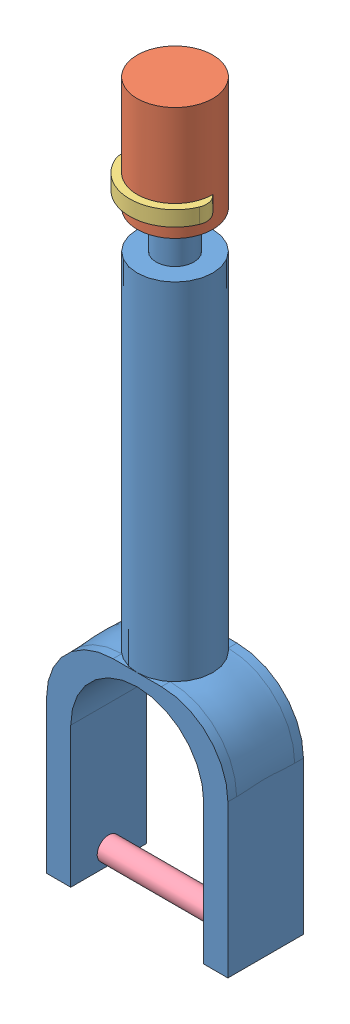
SolidWorks assembly Front gear assembly.SLDASM, configuration Default (file format 11000). Lengths in mm.
Overall size (30.48 120.51 13.97).
4 component instances, 4 part files, 7 mates.
Components (placement in the parent):
- Front gear-1: Front gear.SLDPRT [Default] at (50.6435 33.7041 105.0241) size (30.48 117.24 12.7)
- Front gear top of shock-1: Front gear top of shock.SLDPRT [Default] at (50.6435 98.2353 105.0241) x (-1 0 0) z (0 0 -1) size (12.7 19.05 12.7)
- Gear shock locking pin-1: Gear shock locking pin.SLDPRT [Default] at (50.6435 100.7753 105.0241) size (14.48 2.54 10.79)
- Axel-1: Axel.SLDPRT [Default] at (38.1975 -0.5859 105.0241) x (0 0.832676 0.553761) z (0 0.553761 -0.832676) size (3.81 24.89 3.81)
Mates (geometry in assembly coordinates):
- Concentric3: concentric: cylinder of Front gear top of shock-1 through (50.6435 117.2853 105.0241) axis (0 -1 0) radius 6.35; cylinder of Gear shock locking pin-1 through (50.6435 100.7753 105.0241) axis (0 1 0) radius 6.35
- Concentric4: concentric: cylinder of Front gear top of shock-1 through (50.6435 102.0453 111.3741) axis (0 0 -1) radius 1.27; cylinder of Gear shock locking pin-1 through (50.6435 102.0453 112.6461) axis (0 0 -1) radius 1.27
- Tangent1: tangent: plane of Front gear-1 through (51.9135 102.0453 98.6741) normal (-1 0 0); cylinder of Gear shock locking pin-1 through (50.6435 102.0453 112.6461) axis (0 0 -1) radius 1.27
- Concentric5: concentric: cylinder of Front gear-1 through (50.6435 114.1103 105.0241) axis (0 -1 0) radius 3.175; cylinder of Front gear top of shock-1 through (50.6435 114.1103 105.0241) axis (0 -1 0) radius 3.175
- Coincident3: coincident: plane of Front gear-1 through (50.6435 114.1103 105.0241) normal (0 1 0); plane of Front gear top of shock-1 through (50.6435 114.1103 105.0241) normal (0 -1 0)
- Concentric6: concentric: cylinder of Front gear-1 through (38.1975 -0.5859 105.0241) axis (1 0 0) radius 1.905; cylinder of Axel-1 through (63.0895 -0.5859 105.0241) axis (-1 0 0) radius 1.905
- Coincident4: coincident: plane of Front gear-1 through (63.0895 -0.5859 105.0241) normal (-1 0 0); plane of Axel-1 through (63.0895 -0.5859 105.0241) normal (1 0 0)
